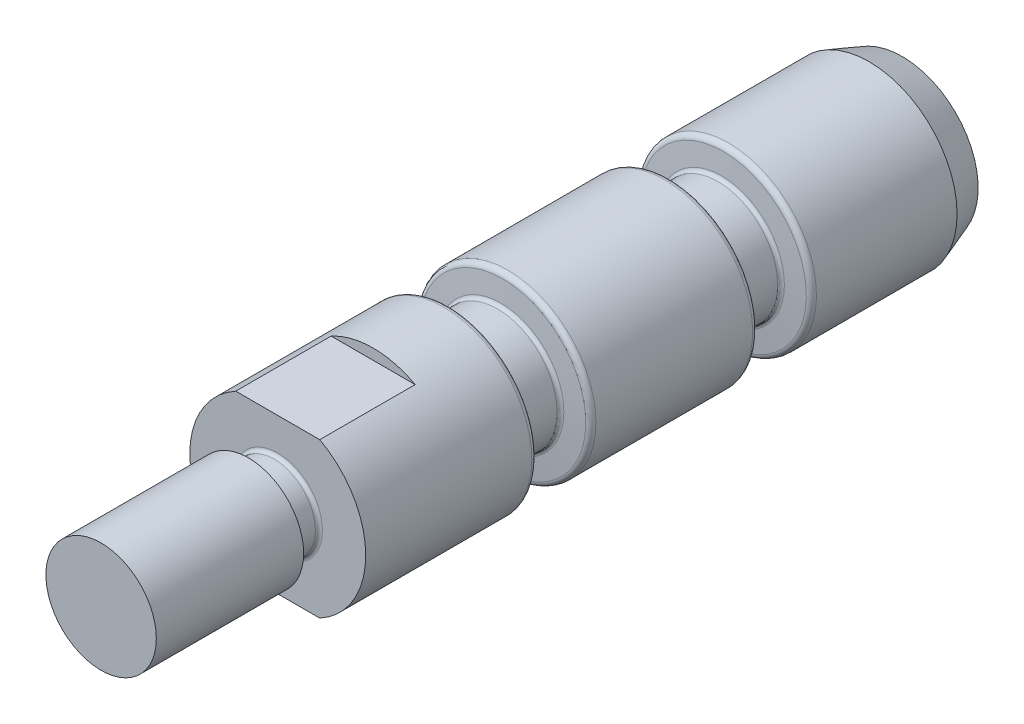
from build123d import *

# Parameters (mm, degrees)
SKETCH1_R                   = 3.96875
EXTRUDE1_DEPTH              = 12.7
SKETCH2_R                   = 6.3246
PLUG_DEPTH                  = 44.8945
F_1_4_20_TAPPED_HOLE1_D     = 5.3086
F_1_4_20_TAPPED_HOLE1_DEPTH = 11.7602
F_1_4_20_TAPPED_HOLE1_TIP   = 1.594864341
CUT_EXTRUDE1_DEPTH          = 100.770793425
CUT_EXTRUDE1_DEPTH_BACK     = 100.770793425
SKETCH32_W                  = 6.858
SKETCH32_H                  = 3.461037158
SKETCH32_H_2                = 2.385805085
CHAMFER1_SIZE               = 2.38125
CHAMFER1_SIZE2              = 0.86670412
FILLET1_R                   = 0.381
FILLET2_R                   = 0.381
FILLET3_R                   = 0.381
FILLET4_R                   = 0.381


with BuildPart() as part:
    # Sketch1 → Extrude1 (new body)
    with BuildSketch(Plane.XY):
        with Locations((-82.55, 82.55)):
            Circle(SKETCH1_R)
    extrude(amount=EXTRUDE1_DEPTH)

    # Sketch2 → Plug (add)
    with BuildSketch(Plane(origin=(0, 0, 0), x_dir=(-1, 0, 0), z_dir=(0, 0, -1))):
        with Locations((82.55, 82.55)):
            Circle(SKETCH2_R)
    extrude(amount=PLUG_DEPTH)

    # Sketch31 → Cut-Revolve6 (revolve, cut)
    with BuildSketch(Plane(origin=(-82.55, 0, 0), x_dir=(0, 0, -1), z_dir=(1, 0, 0)), mode=Mode.PRIVATE) as cut_revolve6_sk:
        with BuildLine():
            Line((0, 86.51875), (-2.1082, 86.51875))
            Line((-2.1082, 86.51875), (-2.1082, 85.7631))
            ThreePointArc((-2.1082, 85.7631), (-2.033805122, 85.583494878), (-1.8542, 85.5091))
            Line((-1.8542, 85.5091), (-0.254, 85.5091))
            ThreePointArc((-0.254, 85.5091), (-0.074394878, 85.583494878), (0, 85.7631))
            Line((0, 85.7631), (0, 86.51875))
        make_face()
    revolve(cut_revolve6_sk.sketch.rotate(Axis((-82.55, 82.55, 12.7), (0, 0, -1)), 90), axis=Axis((-82.55, 82.55, 12.7), (0, 0, -1)), mode=Mode.SUBTRACT)

    # Sketch25 → Cut-Revolve 2-109 (revolve, cut)
    with BuildSketch(Plane(origin=(-82.55, 82.55, -42.8625), x_dir=(0, -1, 0), z_dir=(-1, 0, 0))):
        with BuildLine():
            Line((4.524462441, 14.540533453), (6.395670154, 14.704242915))
            Line((6.395670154, 14.704242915), (6.395670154, 10.800538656))
            Line((6.395670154, 10.800538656), (4.524462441, 10.964248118))
            ThreePointArc((4.524462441, 10.964248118), (4.359331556, 11.045681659), (4.2926, 11.217281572))
            Line((4.2926, 11.217281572), (4.2926, 14.2875))
            ThreePointArc((4.2926, 14.2875), (4.359331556, 14.459099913), (4.524462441, 14.540533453))
        make_face()
    revolve(axis=Axis((-82.55, 82.55, 7.1375), (0, 0, -1)), mode=Mode.SUBTRACT)

    # Sketch27 → Cut-Revolve2 (revolve, cut)
    with BuildSketch(Plane(origin=(-82.55, 82.55, -42.8625), x_dir=(0, -1, 0), z_dir=(-1, 0, 0))):
        with BuildLine():
            Line((4.524462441, 30.415533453), (6.798029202, 30.614444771))
            Line((6.798029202, 30.614444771), (6.762859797, 26.62312839))
            Line((6.762859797, 26.62312839), (4.524462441, 26.818962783))
            ThreePointArc((4.524462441, 26.818962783), (4.359331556, 26.900396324), (4.2926, 27.071996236))
            Line((4.2926, 27.071996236), (4.2926, 30.1625))
            ThreePointArc((4.2926, 30.1625), (4.359331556, 30.334099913), (4.524462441, 30.415533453))
        make_face()
    revolve(axis=Axis((-82.55, 82.55, 7.1375), (0, 0, -1)), mode=Mode.SUBTRACT)

    # 1_4-20 Tapped Hole1
    with Locations(Plane(origin=(0, 0, -44.8945), x_dir=(-1, 0, 0), z_dir=(0, 0, -1))):
        with Locations((82.55, 82.55)):
            Hole(F_1_4_20_TAPPED_HOLE1_D / 2, depth=F_1_4_20_TAPPED_HOLE1_DEPTH)
            with Locations((0, 0, -(F_1_4_20_TAPPED_HOLE1_DEPTH + F_1_4_20_TAPPED_HOLE1_TIP / 2))):  # 118° drill point
                Cone(0, F_1_4_20_TAPPED_HOLE1_D / 2, F_1_4_20_TAPPED_HOLE1_TIP, mode=Mode.SUBTRACT)

    # Sketch32 → Cut-Extrude1 (cut, two sides: drawn at the far end of the back side and taken through both)
    with BuildSketch(Plane(origin=(-82.55, 0, 0), x_dir=(0, 0, -1), z_dir=(1, 0, 0)).offset(-CUT_EXTRUDE1_DEPTH_BACK)):
        with Locations((3.429, 89.836768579)):
            Rectangle(SKETCH32_W, SKETCH32_H)
        with Locations((3.429, 75.800847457)):
            Rectangle(SKETCH32_W, SKETCH32_H_2)
    extrude(amount=CUT_EXTRUDE1_DEPTH + CUT_EXTRUDE1_DEPTH_BACK, mode=Mode.SUBTRACT)

    # Chamfer1
    chamfer1_edges = [part.edges().sort_by_distance(p)[0] for p in [
        (-76.2254, 82.55, -44.8945),
    ]]
    chamfer1_side = [part.faces().sort_by_distance(p)[0] for p in [
        (-76.2254, 82.55, -38.475121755),
    ]]
    chamfer(chamfer1_edges, length=CHAMFER1_SIZE, length2=CHAMFER1_SIZE2, reference=chamfer1_side[0])

    # Fillet1
    fillet1_edges = [part.edges().sort_by_distance(p)[0] for p in [
        (-78.077832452, 87.022167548, -16.201028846),
    ]]
    fillet(fillet1_edges, radius=FILLET1_R)

    # Fillet2
    fillet2_edges = [part.edges().sort_by_distance(p)[0] for p in [
        (-78.077832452, 87.022167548, -32.055743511),
    ]]
    fillet(fillet2_edges, radius=FILLET2_R)

    # Fillet3
    fillet3_edges = [part.edges().sort_by_distance(p)[0] for p in [
        (-87.022167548, 78.077832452, -12.289474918),
    ]]
    fillet(fillet3_edges, radius=FILLET3_R)

    # Fillet4
    fillet4_edges = [part.edges().sort_by_distance(p)[0] for p in [
        (-87.022167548, 78.077832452, -28.164474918),
    ]]
    fillet(fillet4_edges, radius=FILLET4_R)


solid = part.part
